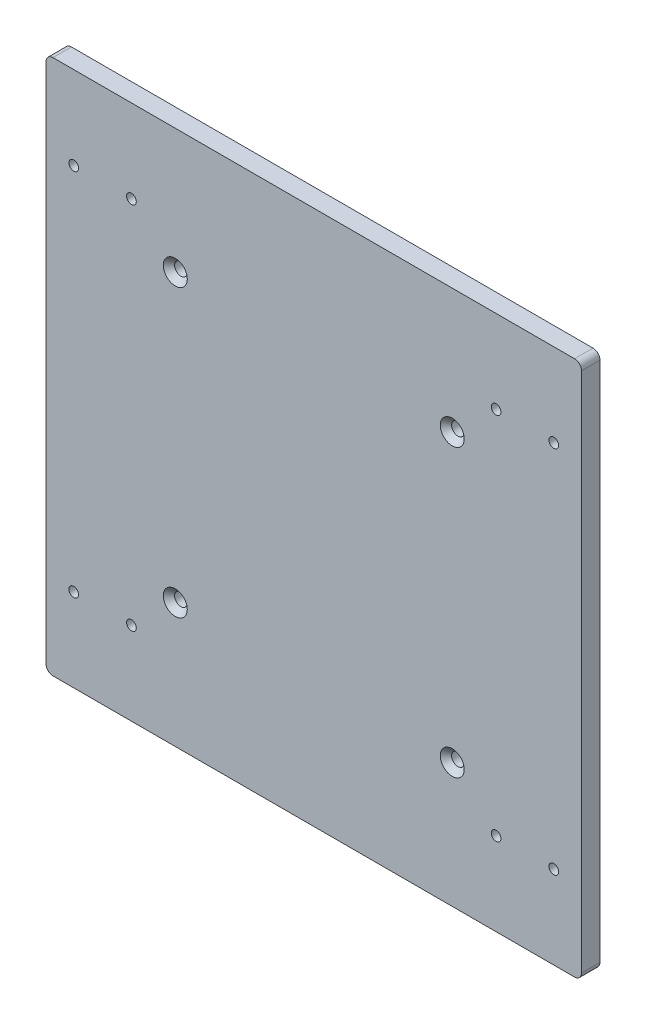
ISO-10303-21;
HEADER;
FILE_DESCRIPTION(('STEP AP214'),'2;1');
FILE_NAME('part.step','',(''),(''),'','','');
FILE_SCHEMA(('AUTOMOTIVE_DESIGN { 1 0 10303 214 1 1 1 1 }'));
ENDSEC;
DATA;
#1=APPLICATION_CONTEXT('core data for automotive mechanical design processes');
#2=APPLICATION_PROTOCOL_DEFINITION('international standard','automotive_design',2000,#1);
#3=PRODUCT_CONTEXT('',#1,'mechanical');
#4=PRODUCT('Part','Part','',(#3));
#5=PRODUCT_RELATED_PRODUCT_CATEGORY('part','',(#4));
#6=PRODUCT_DEFINITION_FORMATION('','',#4);
#7=PRODUCT_DEFINITION_CONTEXT('part definition',#1,'design');
#8=PRODUCT_DEFINITION('design','',#6,#7);
#9=PRODUCT_DEFINITION_SHAPE('','',#8);
#10=(LENGTH_UNIT() NAMED_UNIT(*) SI_UNIT(.MILLI.,.METRE.));
#11=(NAMED_UNIT(*) PLANE_ANGLE_UNIT() SI_UNIT($,.RADIAN.));
#12=(NAMED_UNIT(*) SI_UNIT($,.STERADIAN.) SOLID_ANGLE_UNIT());
#13=UNCERTAINTY_MEASURE_WITH_UNIT(LENGTH_MEASURE(1.E-05),#10,'distance_accuracy_value','');
#14=(GEOMETRIC_REPRESENTATION_CONTEXT(3) GLOBAL_UNCERTAINTY_ASSIGNED_CONTEXT((#13)) GLOBAL_UNIT_ASSIGNED_CONTEXT((#10,
#11,#12)) REPRESENTATION_CONTEXT('',''));
#15=CARTESIAN_POINT('',(0.,0.,0.));
#16=DIRECTION('',(0.,0.,1.));
#17=DIRECTION('',(1.,0.,0.));
#18=AXIS2_PLACEMENT_3D('',#15,#16,#17);
#19=CARTESIAN_POINT('',(-116.,116.,8.));
#20=DIRECTION('',(1.,0.,0.));
#21=DIRECTION('',(0.,0.,-1.));
#22=AXIS2_PLACEMENT_3D('',#19,#20,#21);
#23=PLANE('',#22);
#24=DIRECTION('',(0.,-1.,0.));
#25=VECTOR('',#24,1.);
#26=CARTESIAN_POINT('',(-116.,116.,8.));
#27=LINE('',#26,#25);
#28=CARTESIAN_POINT('',(-116.,113.,8.));
#29=VERTEX_POINT('',#28);
#30=CARTESIAN_POINT('',(-116.,-113.,8.));
#31=VERTEX_POINT('',#30);
#32=EDGE_CURVE('E121',#29,#31,#27,.T.);
#33=ORIENTED_EDGE('',*,*,#32,.F.);
#34=DIRECTION('',(0.,0.,-1.));
#35=VECTOR('',#34,1.);
#36=CARTESIAN_POINT('',(-116.,113.,8.));
#37=LINE('',#36,#35);
#38=CARTESIAN_POINT('',(-116.,113.,0.));
#39=VERTEX_POINT('',#38);
#40=EDGE_CURVE('E106',#29,#39,#37,.T.);
#41=ORIENTED_EDGE('',*,*,#40,.T.);
#42=DIRECTION('',(0.,-1.,0.));
#43=VECTOR('',#42,1.);
#44=CARTESIAN_POINT('',(-116.,116.,0.));
#45=LINE('',#44,#43);
#46=CARTESIAN_POINT('',(-116.,-113.,0.));
#47=VERTEX_POINT('',#46);
#48=EDGE_CURVE('E118',#39,#47,#45,.T.);
#49=ORIENTED_EDGE('',*,*,#48,.T.);
#50=DIRECTION('',(0.,0.,-1.));
#51=VECTOR('',#50,1.);
#52=CARTESIAN_POINT('',(-116.,-113.,8.));
#53=LINE('',#52,#51);
#54=EDGE_CURVE('E123',#47,#31,#53,.F.);
#55=ORIENTED_EDGE('',*,*,#54,.T.);
#56=EDGE_LOOP('',(#33,#41,#49,#55));
#57=FACE_BOUND('',#56,.T.);
#58=ADVANCED_FACE('F36',(#57),#23,.F.);
#59=CARTESIAN_POINT('',(-116.,-116.,8.));
#60=DIRECTION('',(0.,1.,0.));
#61=DIRECTION('',(0.,0.,1.));
#62=AXIS2_PLACEMENT_3D('',#59,#60,#61);
#63=PLANE('',#62);
#64=DIRECTION('',(1.,0.,0.));
#65=VECTOR('',#64,1.);
#66=CARTESIAN_POINT('',(-116.,-116.,0.));
#67=LINE('',#66,#65);
#68=CARTESIAN_POINT('',(-113.,-116.,0.));
#69=VERTEX_POINT('',#68);
#70=CARTESIAN_POINT('',(113.,-116.,0.));
#71=VERTEX_POINT('',#70);
#72=EDGE_CURVE('E127',#69,#71,#67,.T.);
#73=ORIENTED_EDGE('',*,*,#72,.T.);
#74=DIRECTION('',(0.,0.,-1.));
#75=VECTOR('',#74,1.);
#76=CARTESIAN_POINT('',(113.,-116.,8.));
#77=LINE('',#76,#75);
#78=CARTESIAN_POINT('',(113.,-116.,8.));
#79=VERTEX_POINT('',#78);
#80=EDGE_CURVE('E11',#71,#79,#77,.F.);
#81=ORIENTED_EDGE('',*,*,#80,.T.);
#82=DIRECTION('',(1.,0.,0.));
#83=VECTOR('',#82,1.);
#84=CARTESIAN_POINT('',(-116.,-116.,8.));
#85=LINE('',#84,#83);
#86=CARTESIAN_POINT('',(-113.,-116.,8.));
#87=VERTEX_POINT('',#86);
#88=EDGE_CURVE('E167',#87,#79,#85,.T.);
#89=ORIENTED_EDGE('',*,*,#88,.F.);
#90=DIRECTION('',(0.,0.,-1.));
#91=VECTOR('',#90,1.);
#92=CARTESIAN_POINT('',(-113.,-116.,8.));
#93=LINE('',#92,#91);
#94=EDGE_CURVE('E44',#87,#69,#93,.T.);
#95=ORIENTED_EDGE('',*,*,#94,.T.);
#96=EDGE_LOOP('',(#73,#81,#89,#95));
#97=FACE_BOUND('',#96,.T.);
#98=ADVANCED_FACE('F165',(#97),#63,.F.);
#99=CARTESIAN_POINT('',(116.,116.,8.));
#100=DIRECTION('',(-1.,0.,0.));
#101=DIRECTION('',(0.,0.,1.));
#102=AXIS2_PLACEMENT_3D('',#99,#100,#101);
#103=PLANE('',#102);
#104=DIRECTION('',(0.,1.,0.));
#105=VECTOR('',#104,1.);
#106=CARTESIAN_POINT('',(116.,116.,0.));
#107=LINE('',#106,#105);
#108=CARTESIAN_POINT('',(116.,-113.,0.));
#109=VERTEX_POINT('',#108);
#110=CARTESIAN_POINT('',(116.,113.,0.));
#111=VERTEX_POINT('',#110);
#112=EDGE_CURVE('E131',#109,#111,#107,.T.);
#113=ORIENTED_EDGE('',*,*,#112,.T.);
#114=DIRECTION('',(0.,0.,-1.));
#115=VECTOR('',#114,1.);
#116=CARTESIAN_POINT('',(116.,113.,8.));
#117=LINE('',#116,#115);
#118=CARTESIAN_POINT('',(116.,113.,8.));
#119=VERTEX_POINT('',#118);
#120=EDGE_CURVE('E51',#111,#119,#117,.F.);
#121=ORIENTED_EDGE('',*,*,#120,.T.);
#122=DIRECTION('',(0.,1.,0.));
#123=VECTOR('',#122,1.);
#124=CARTESIAN_POINT('',(116.,116.,8.));
#125=LINE('',#124,#123);
#126=CARTESIAN_POINT('',(116.,-113.,8.));
#127=VERTEX_POINT('',#126);
#128=EDGE_CURVE('E175',#127,#119,#125,.T.);
#129=ORIENTED_EDGE('',*,*,#128,.F.);
#130=DIRECTION('',(0.,0.,-1.));
#131=VECTOR('',#130,1.);
#132=CARTESIAN_POINT('',(116.,-113.,8.));
#133=LINE('',#132,#131);
#134=EDGE_CURVE('E158',#127,#109,#133,.T.);
#135=ORIENTED_EDGE('',*,*,#134,.T.);
#136=EDGE_LOOP('',(#113,#121,#129,#135));
#137=FACE_BOUND('',#136,.T.);
#138=ADVANCED_FACE('F174',(#137),#103,.F.);
#139=CARTESIAN_POINT('',(-116.,116.,8.));
#140=DIRECTION('',(0.,-1.,0.));
#141=DIRECTION('',(0.,0.,-1.));
#142=AXIS2_PLACEMENT_3D('',#139,#140,#141);
#143=PLANE('',#142);
#144=DIRECTION('',(-1.,0.,0.));
#145=VECTOR('',#144,1.);
#146=CARTESIAN_POINT('',(-116.,116.,0.));
#147=LINE('',#146,#145);
#148=CARTESIAN_POINT('',(113.,116.,0.));
#149=VERTEX_POINT('',#148);
#150=CARTESIAN_POINT('',(-113.,116.,0.));
#151=VERTEX_POINT('',#150);
#152=EDGE_CURVE('E141',#149,#151,#147,.T.);
#153=ORIENTED_EDGE('',*,*,#152,.T.);
#154=DIRECTION('',(0.,0.,-1.));
#155=VECTOR('',#154,1.);
#156=CARTESIAN_POINT('',(-113.,116.,8.));
#157=LINE('',#156,#155);
#158=CARTESIAN_POINT('',(-113.,116.,8.));
#159=VERTEX_POINT('',#158);
#160=EDGE_CURVE('E107',#151,#159,#157,.F.);
#161=ORIENTED_EDGE('',*,*,#160,.T.);
#162=DIRECTION('',(-1.,0.,0.));
#163=VECTOR('',#162,1.);
#164=CARTESIAN_POINT('',(-116.,116.,8.));
#165=LINE('',#164,#163);
#166=CARTESIAN_POINT('',(113.,116.,8.));
#167=VERTEX_POINT('',#166);
#168=EDGE_CURVE('E137',#167,#159,#165,.T.);
#169=ORIENTED_EDGE('',*,*,#168,.F.);
#170=DIRECTION('',(0.,0.,-1.));
#171=VECTOR('',#170,1.);
#172=CARTESIAN_POINT('',(113.,116.,8.));
#173=LINE('',#172,#171);
#174=EDGE_CURVE('E112',#167,#149,#173,.T.);
#175=ORIENTED_EDGE('',*,*,#174,.T.);
#176=EDGE_LOOP('',(#153,#161,#169,#175));
#177=FACE_BOUND('',#176,.T.);
#178=ADVANCED_FACE('F304',(#177),#143,.F.);
#179=CARTESIAN_POINT('',(0.,0.,8.));
#180=DIRECTION('',(0.,0.,1.));
#181=DIRECTION('',(1.,0.,0.));
#182=AXIS2_PLACEMENT_3D('',#179,#180,#181);
#183=PLANE('',#182);
#184=CARTESIAN_POINT('',(-79.,-80.,8.));
#185=DIRECTION('',(0.,0.,-1.));
#186=DIRECTION('',(-1.,0.,0.));
#187=AXIS2_PLACEMENT_3D('',#184,#185,#186);
#188=CIRCLE('',#187,2.1);
#189=CARTESIAN_POINT('',(-81.1,-80.,8.));
#190=VERTEX_POINT('',#189);
#191=EDGE_CURVE('E255',#190,#190,#188,.T.);
#192=ORIENTED_EDGE('',*,*,#191,.T.);
#193=EDGE_LOOP('',(#192));
#194=FACE_BOUND('',#193,.T.);
#195=CARTESIAN_POINT('',(-104.,-80.,8.));
#196=DIRECTION('',(0.,0.,-1.));
#197=DIRECTION('',(-1.,0.,0.));
#198=AXIS2_PLACEMENT_3D('',#195,#196,#197);
#199=CIRCLE('',#198,2.1);
#200=CARTESIAN_POINT('',(-106.1,-80.,8.));
#201=VERTEX_POINT('',#200);
#202=EDGE_CURVE('E249',#201,#201,#199,.T.);
#203=ORIENTED_EDGE('',*,*,#202,.T.);
#204=EDGE_LOOP('',(#203));
#205=FACE_BOUND('',#204,.T.);
#206=CARTESIAN_POINT('',(79.,-80.,8.));
#207=DIRECTION('',(0.,0.,-1.));
#208=DIRECTION('',(-1.,0.,0.));
#209=AXIS2_PLACEMENT_3D('',#206,#207,#208);
#210=CIRCLE('',#209,2.09999999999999);
#211=CARTESIAN_POINT('',(76.9,-80.,8.));
#212=VERTEX_POINT('',#211);
#213=EDGE_CURVE('E243',#212,#212,#210,.T.);
#214=ORIENTED_EDGE('',*,*,#213,.T.);
#215=EDGE_LOOP('',(#214));
#216=FACE_BOUND('',#215,.T.);
#217=CARTESIAN_POINT('',(104.,-80.,8.));
#218=DIRECTION('',(0.,0.,-1.));
#219=DIRECTION('',(-1.,0.,0.));
#220=AXIS2_PLACEMENT_3D('',#217,#218,#219);
#221=CIRCLE('',#220,2.09999999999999);
#222=CARTESIAN_POINT('',(101.9,-80.,8.));
#223=VERTEX_POINT('',#222);
#224=EDGE_CURVE('E237',#223,#223,#221,.T.);
#225=ORIENTED_EDGE('',*,*,#224,.T.);
#226=EDGE_LOOP('',(#225));
#227=FACE_BOUND('',#226,.T.);
#228=CARTESIAN_POINT('',(79.,80.,8.));
#229=DIRECTION('',(0.,0.,-1.));
#230=DIRECTION('',(-1.,0.,0.));
#231=AXIS2_PLACEMENT_3D('',#228,#229,#230);
#232=CIRCLE('',#231,2.09999999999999);
#233=CARTESIAN_POINT('',(76.9,80.,8.));
#234=VERTEX_POINT('',#233);
#235=EDGE_CURVE('E231',#234,#234,#232,.T.);
#236=ORIENTED_EDGE('',*,*,#235,.T.);
#237=EDGE_LOOP('',(#236));
#238=FACE_BOUND('',#237,.T.);
#239=CARTESIAN_POINT('',(104.,80.,8.));
#240=DIRECTION('',(0.,0.,-1.));
#241=DIRECTION('',(-1.,0.,0.));
#242=AXIS2_PLACEMENT_3D('',#239,#240,#241);
#243=CIRCLE('',#242,2.09999999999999);
#244=CARTESIAN_POINT('',(101.9,80.,8.));
#245=VERTEX_POINT('',#244);
#246=EDGE_CURVE('E225',#245,#245,#243,.T.);
#247=ORIENTED_EDGE('',*,*,#246,.T.);
#248=EDGE_LOOP('',(#247));
#249=FACE_BOUND('',#248,.T.);
#250=CARTESIAN_POINT('',(-104.,80.,8.));
#251=DIRECTION('',(0.,0.,-1.));
#252=DIRECTION('',(-1.,0.,0.));
#253=AXIS2_PLACEMENT_3D('',#250,#251,#252);
#254=CIRCLE('',#253,2.09999999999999);
#255=CARTESIAN_POINT('',(-106.1,80.,8.));
#256=VERTEX_POINT('',#255);
#257=EDGE_CURVE('E219',#256,#256,#254,.T.);
#258=ORIENTED_EDGE('',*,*,#257,.T.);
#259=EDGE_LOOP('',(#258));
#260=FACE_BOUND('',#259,.T.);
#261=CARTESIAN_POINT('',(-79.,80.,8.));
#262=DIRECTION('',(0.,0.,-1.));
#263=DIRECTION('',(-1.,0.,0.));
#264=AXIS2_PLACEMENT_3D('',#261,#262,#263);
#265=CIRCLE('',#264,2.09999999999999);
#266=CARTESIAN_POINT('',(-81.1,80.,8.));
#267=VERTEX_POINT('',#266);
#268=EDGE_CURVE('E213',#267,#267,#265,.T.);
#269=ORIENTED_EDGE('',*,*,#268,.T.);
#270=EDGE_LOOP('',(#269));
#271=FACE_BOUND('',#270,.T.);
#272=CARTESIAN_POINT('',(60.,62.,8.));
#273=DIRECTION('',(0.,0.,1.));
#274=DIRECTION('',(1.,0.,0.));
#275=AXIS2_PLACEMENT_3D('',#272,#273,#274);
#276=CIRCLE('',#275,5.2);
#277=CARTESIAN_POINT('',(65.2,62.,8.));
#278=VERTEX_POINT('',#277);
#279=EDGE_CURVE('E210',#278,#278,#276,.T.);
#280=ORIENTED_EDGE('',*,*,#279,.F.);
#281=EDGE_LOOP('',(#280));
#282=FACE_BOUND('',#281,.T.);
#283=CARTESIAN_POINT('',(-60.,-62.,8.));
#284=DIRECTION('',(0.,0.,1.));
#285=DIRECTION('',(1.,0.,0.));
#286=AXIS2_PLACEMENT_3D('',#283,#284,#285);
#287=CIRCLE('',#286,5.2);
#288=CARTESIAN_POINT('',(-54.8,-62.,8.));
#289=VERTEX_POINT('',#288);
#290=EDGE_CURVE('E201',#289,#289,#287,.T.);
#291=ORIENTED_EDGE('',*,*,#290,.F.);
#292=EDGE_LOOP('',(#291));
#293=FACE_BOUND('',#292,.T.);
#294=CARTESIAN_POINT('',(-60.,62.,8.));
#295=DIRECTION('',(0.,0.,1.));
#296=DIRECTION('',(1.,0.,0.));
#297=AXIS2_PLACEMENT_3D('',#294,#295,#296);
#298=CIRCLE('',#297,5.2);
#299=CARTESIAN_POINT('',(-54.8,62.,8.));
#300=VERTEX_POINT('',#299);
#301=EDGE_CURVE('E192',#300,#300,#298,.T.);
#302=ORIENTED_EDGE('',*,*,#301,.F.);
#303=EDGE_LOOP('',(#302));
#304=FACE_BOUND('',#303,.T.);
#305=CARTESIAN_POINT('',(60.,-62.,8.));
#306=DIRECTION('',(0.,0.,1.));
#307=DIRECTION('',(1.,0.,0.));
#308=AXIS2_PLACEMENT_3D('',#305,#306,#307);
#309=CIRCLE('',#308,5.2);
#310=CARTESIAN_POINT('',(65.2,-62.,8.));
#311=VERTEX_POINT('',#310);
#312=EDGE_CURVE('E183',#311,#311,#309,.T.);
#313=ORIENTED_EDGE('',*,*,#312,.F.);
#314=EDGE_LOOP('',(#313));
#315=FACE_BOUND('',#314,.T.);
#316=ORIENTED_EDGE('',*,*,#168,.T.);
#317=CARTESIAN_POINT('',(-113.,113.,8.));
#318=DIRECTION('',(0.,0.,1.));
#319=DIRECTION('',(1.,0.,0.));
#320=AXIS2_PLACEMENT_3D('',#317,#318,#319);
#321=CIRCLE('',#320,3.);
#322=EDGE_CURVE('E156',#159,#29,#321,.T.);
#323=ORIENTED_EDGE('',*,*,#322,.T.);
#324=ORIENTED_EDGE('',*,*,#32,.T.);
#325=CARTESIAN_POINT('',(-113.,-113.,8.));
#326=DIRECTION('',(0.,0.,1.));
#327=DIRECTION('',(1.,0.,0.));
#328=AXIS2_PLACEMENT_3D('',#325,#326,#327);
#329=CIRCLE('',#328,3.);
#330=EDGE_CURVE('E151',#31,#87,#329,.T.);
#331=ORIENTED_EDGE('',*,*,#330,.T.);
#332=ORIENTED_EDGE('',*,*,#88,.T.);
#333=CARTESIAN_POINT('',(113.,-113.,8.));
#334=DIRECTION('',(0.,0.,1.));
#335=DIRECTION('',(1.,0.,0.));
#336=AXIS2_PLACEMENT_3D('',#333,#334,#335);
#337=CIRCLE('',#336,3.);
#338=EDGE_CURVE('E58',#79,#127,#337,.T.);
#339=ORIENTED_EDGE('',*,*,#338,.T.);
#340=ORIENTED_EDGE('',*,*,#128,.T.);
#341=CARTESIAN_POINT('',(113.,113.,8.));
#342=DIRECTION('',(0.,0.,1.));
#343=DIRECTION('',(1.,0.,0.));
#344=AXIS2_PLACEMENT_3D('',#341,#342,#343);
#345=CIRCLE('',#344,3.);
#346=EDGE_CURVE('E154',#119,#167,#345,.T.);
#347=ORIENTED_EDGE('',*,*,#346,.T.);
#348=EDGE_LOOP('',(#316,#323,#324,#331,#332,#339,#340,#347));
#349=FACE_BOUND('',#348,.T.);
#350=ADVANCED_FACE('F267',(#194,#205,#216,#227,#238,#249,#260,#271,#282,#293,#304,#315,#349),
#183,.T.);
#351=CARTESIAN_POINT('',(0.,0.,0.));
#352=DIRECTION('',(0.,0.,1.));
#353=DIRECTION('',(1.,0.,0.));
#354=AXIS2_PLACEMENT_3D('',#351,#352,#353);
#355=PLANE('',#354);
#356=CARTESIAN_POINT('',(-79.,-80.,0.));
#357=DIRECTION('',(0.,0.,-1.));
#358=DIRECTION('',(-1.,0.,0.));
#359=AXIS2_PLACEMENT_3D('',#356,#357,#358);
#360=CIRCLE('',#359,2.09999999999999);
#361=CARTESIAN_POINT('',(-81.1,-80.,0.));
#362=VERTEX_POINT('',#361);
#363=EDGE_CURVE('E258',#362,#362,#360,.T.);
#364=ORIENTED_EDGE('',*,*,#363,.F.);
#365=EDGE_LOOP('',(#364));
#366=FACE_BOUND('',#365,.T.);
#367=CARTESIAN_POINT('',(-104.,-80.,0.));
#368=DIRECTION('',(0.,0.,-1.));
#369=DIRECTION('',(-1.,0.,0.));
#370=AXIS2_PLACEMENT_3D('',#367,#368,#369);
#371=CIRCLE('',#370,2.09999999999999);
#372=CARTESIAN_POINT('',(-106.1,-80.,0.));
#373=VERTEX_POINT('',#372);
#374=EDGE_CURVE('E252',#373,#373,#371,.T.);
#375=ORIENTED_EDGE('',*,*,#374,.F.);
#376=EDGE_LOOP('',(#375));
#377=FACE_BOUND('',#376,.T.);
#378=CARTESIAN_POINT('',(79.,-80.,0.));
#379=DIRECTION('',(0.,0.,-1.));
#380=DIRECTION('',(-1.,0.,0.));
#381=AXIS2_PLACEMENT_3D('',#378,#379,#380);
#382=CIRCLE('',#381,2.09999999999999);
#383=CARTESIAN_POINT('',(76.9,-80.,0.));
#384=VERTEX_POINT('',#383);
#385=EDGE_CURVE('E246',#384,#384,#382,.T.);
#386=ORIENTED_EDGE('',*,*,#385,.F.);
#387=EDGE_LOOP('',(#386));
#388=FACE_BOUND('',#387,.T.);
#389=CARTESIAN_POINT('',(104.,-80.,0.));
#390=DIRECTION('',(0.,0.,-1.));
#391=DIRECTION('',(-1.,0.,0.));
#392=AXIS2_PLACEMENT_3D('',#389,#390,#391);
#393=CIRCLE('',#392,2.09999999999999);
#394=CARTESIAN_POINT('',(101.9,-80.,0.));
#395=VERTEX_POINT('',#394);
#396=EDGE_CURVE('E240',#395,#395,#393,.T.);
#397=ORIENTED_EDGE('',*,*,#396,.F.);
#398=EDGE_LOOP('',(#397));
#399=FACE_BOUND('',#398,.T.);
#400=CARTESIAN_POINT('',(79.,80.,0.));
#401=DIRECTION('',(0.,0.,-1.));
#402=DIRECTION('',(-1.,0.,0.));
#403=AXIS2_PLACEMENT_3D('',#400,#401,#402);
#404=CIRCLE('',#403,2.09999999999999);
#405=CARTESIAN_POINT('',(76.9,80.,0.));
#406=VERTEX_POINT('',#405);
#407=EDGE_CURVE('E234',#406,#406,#404,.T.);
#408=ORIENTED_EDGE('',*,*,#407,.F.);
#409=EDGE_LOOP('',(#408));
#410=FACE_BOUND('',#409,.T.);
#411=CARTESIAN_POINT('',(104.,80.,0.));
#412=DIRECTION('',(0.,0.,-1.));
#413=DIRECTION('',(-1.,0.,0.));
#414=AXIS2_PLACEMENT_3D('',#411,#412,#413);
#415=CIRCLE('',#414,2.09999999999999);
#416=CARTESIAN_POINT('',(101.9,80.,0.));
#417=VERTEX_POINT('',#416);
#418=EDGE_CURVE('E228',#417,#417,#415,.T.);
#419=ORIENTED_EDGE('',*,*,#418,.F.);
#420=EDGE_LOOP('',(#419));
#421=FACE_BOUND('',#420,.T.);
#422=CARTESIAN_POINT('',(-104.,80.,0.));
#423=DIRECTION('',(0.,0.,-1.));
#424=DIRECTION('',(-1.,0.,0.));
#425=AXIS2_PLACEMENT_3D('',#422,#423,#424);
#426=CIRCLE('',#425,2.09999999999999);
#427=CARTESIAN_POINT('',(-106.1,80.,0.));
#428=VERTEX_POINT('',#427);
#429=EDGE_CURVE('E222',#428,#428,#426,.T.);
#430=ORIENTED_EDGE('',*,*,#429,.F.);
#431=EDGE_LOOP('',(#430));
#432=FACE_BOUND('',#431,.T.);
#433=CARTESIAN_POINT('',(-79.,80.,0.));
#434=DIRECTION('',(0.,0.,-1.));
#435=DIRECTION('',(-1.,0.,0.));
#436=AXIS2_PLACEMENT_3D('',#433,#434,#435);
#437=CIRCLE('',#436,2.09999999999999);
#438=CARTESIAN_POINT('',(-81.1,80.,0.));
#439=VERTEX_POINT('',#438);
#440=EDGE_CURVE('E216',#439,#439,#437,.T.);
#441=ORIENTED_EDGE('',*,*,#440,.F.);
#442=EDGE_LOOP('',(#441));
#443=FACE_BOUND('',#442,.T.);
#444=CARTESIAN_POINT('',(60.,62.,0.));
#445=DIRECTION('',(0.,0.,1.));
#446=DIRECTION('',(1.,0.,0.));
#447=AXIS2_PLACEMENT_3D('',#444,#445,#446);
#448=CIRCLE('',#447,2.75);
#449=CARTESIAN_POINT('',(62.75,62.,0.));
#450=VERTEX_POINT('',#449);
#451=EDGE_CURVE('E204',#450,#450,#448,.T.);
#452=ORIENTED_EDGE('',*,*,#451,.T.);
#453=EDGE_LOOP('',(#452));
#454=FACE_BOUND('',#453,.T.);
#455=CARTESIAN_POINT('',(-60.,-62.,0.));
#456=DIRECTION('',(0.,0.,1.));
#457=DIRECTION('',(1.,0.,0.));
#458=AXIS2_PLACEMENT_3D('',#455,#456,#457);
#459=CIRCLE('',#458,2.75);
#460=CARTESIAN_POINT('',(-57.25,-62.,0.));
#461=VERTEX_POINT('',#460);
#462=EDGE_CURVE('E195',#461,#461,#459,.T.);
#463=ORIENTED_EDGE('',*,*,#462,.T.);
#464=EDGE_LOOP('',(#463));
#465=FACE_BOUND('',#464,.T.);
#466=CARTESIAN_POINT('',(-60.,62.,0.));
#467=DIRECTION('',(0.,0.,1.));
#468=DIRECTION('',(1.,0.,0.));
#469=AXIS2_PLACEMENT_3D('',#466,#467,#468);
#470=CIRCLE('',#469,2.75);
#471=CARTESIAN_POINT('',(-57.25,62.,0.));
#472=VERTEX_POINT('',#471);
#473=EDGE_CURVE('E186',#472,#472,#470,.T.);
#474=ORIENTED_EDGE('',*,*,#473,.T.);
#475=EDGE_LOOP('',(#474));
#476=FACE_BOUND('',#475,.T.);
#477=CARTESIAN_POINT('',(60.,-62.,0.));
#478=DIRECTION('',(0.,0.,1.));
#479=DIRECTION('',(1.,0.,0.));
#480=AXIS2_PLACEMENT_3D('',#477,#478,#479);
#481=CIRCLE('',#480,2.75);
#482=CARTESIAN_POINT('',(62.75,-62.,0.));
#483=VERTEX_POINT('',#482);
#484=EDGE_CURVE('E128',#483,#483,#481,.T.);
#485=ORIENTED_EDGE('',*,*,#484,.T.);
#486=EDGE_LOOP('',(#485));
#487=FACE_BOUND('',#486,.T.);
#488=ORIENTED_EDGE('',*,*,#48,.F.);
#489=CARTESIAN_POINT('',(-113.,113.,0.));
#490=DIRECTION('',(0.,0.,1.));
#491=DIRECTION('',(1.,0.,0.));
#492=AXIS2_PLACEMENT_3D('',#489,#490,#491);
#493=CIRCLE('',#492,3.);
#494=EDGE_CURVE('E102',#39,#151,#493,.F.);
#495=ORIENTED_EDGE('',*,*,#494,.T.);
#496=ORIENTED_EDGE('',*,*,#152,.F.);
#497=CARTESIAN_POINT('',(113.,113.,0.));
#498=DIRECTION('',(0.,0.,1.));
#499=DIRECTION('',(1.,0.,0.));
#500=AXIS2_PLACEMENT_3D('',#497,#498,#499);
#501=CIRCLE('',#500,3.);
#502=EDGE_CURVE('E113',#149,#111,#501,.F.);
#503=ORIENTED_EDGE('',*,*,#502,.T.);
#504=ORIENTED_EDGE('',*,*,#112,.F.);
#505=CARTESIAN_POINT('',(113.,-113.,0.));
#506=DIRECTION('',(0.,0.,1.));
#507=DIRECTION('',(1.,0.,0.));
#508=AXIS2_PLACEMENT_3D('',#505,#506,#507);
#509=CIRCLE('',#508,3.);
#510=EDGE_CURVE('E145',#109,#71,#509,.F.);
#511=ORIENTED_EDGE('',*,*,#510,.T.);
#512=ORIENTED_EDGE('',*,*,#72,.F.);
#513=CARTESIAN_POINT('',(-113.,-113.,0.));
#514=DIRECTION('',(0.,0.,1.));
#515=DIRECTION('',(1.,0.,0.));
#516=AXIS2_PLACEMENT_3D('',#513,#514,#515);
#517=CIRCLE('',#516,3.);
#518=EDGE_CURVE('E122',#69,#47,#517,.F.);
#519=ORIENTED_EDGE('',*,*,#518,.T.);
#520=EDGE_LOOP('',(#488,#495,#496,#503,#504,#511,#512,#519));
#521=FACE_BOUND('',#520,.T.);
#522=ADVANCED_FACE('F125',(#366,#377,#388,#399,#410,#421,#432,#443,#454,#465,#476,#487,#521),
#355,.F.);
#523=CARTESIAN_POINT('',(60.,-62.,8.));
#524=DIRECTION('',(0.,0.,1.));
#525=DIRECTION('',(1.,0.,0.));
#526=AXIS2_PLACEMENT_3D('',#523,#524,#525);
#527=CYLINDRICAL_SURFACE('',#526,2.75);
#528=ORIENTED_EDGE('',*,*,#484,.F.);
#529=EDGE_LOOP('',(#528));
#530=FACE_BOUND('',#529,.T.);
#531=CARTESIAN_POINT('',(60.,-62.,5.55));
#532=DIRECTION('',(0.,0.,1.));
#533=DIRECTION('',(1.,0.,0.));
#534=AXIS2_PLACEMENT_3D('',#531,#532,#533);
#535=CIRCLE('',#534,2.75);
#536=CARTESIAN_POINT('',(62.75,-62.,5.55));
#537=VERTEX_POINT('',#536);
#538=EDGE_CURVE('E134',#537,#537,#535,.T.);
#539=ORIENTED_EDGE('',*,*,#538,.T.);
#540=EDGE_LOOP('',(#539));
#541=FACE_BOUND('',#540,.T.);
#542=ADVANCED_FACE('F266',(#530,#541),#527,.F.);
#543=CARTESIAN_POINT('',(60.,-62.,8.));
#544=DIRECTION('',(0.,0.,1.));
#545=DIRECTION('',(1.,0.,0.));
#546=AXIS2_PLACEMENT_3D('',#543,#544,#545);
#547=CONICAL_SURFACE('',#546,5.2,0.785398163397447);
#548=ORIENTED_EDGE('',*,*,#538,.F.);
#549=EDGE_LOOP('',(#548));
#550=FACE_BOUND('',#549,.T.);
#551=ORIENTED_EDGE('',*,*,#312,.T.);
#552=EDGE_LOOP('',(#551));
#553=FACE_BOUND('',#552,.T.);
#554=ADVANCED_FACE('F293',(#550,#553),#547,.F.);
#555=CARTESIAN_POINT('',(-60.,62.,8.));
#556=DIRECTION('',(0.,0.,1.));
#557=DIRECTION('',(1.,0.,0.));
#558=AXIS2_PLACEMENT_3D('',#555,#556,#557);
#559=CYLINDRICAL_SURFACE('',#558,2.75);
#560=ORIENTED_EDGE('',*,*,#473,.F.);
#561=EDGE_LOOP('',(#560));
#562=FACE_BOUND('',#561,.T.);
#563=CARTESIAN_POINT('',(-60.,62.,5.55));
#564=DIRECTION('',(0.,0.,1.));
#565=DIRECTION('',(1.,0.,0.));
#566=AXIS2_PLACEMENT_3D('',#563,#564,#565);
#567=CIRCLE('',#566,2.75);
#568=CARTESIAN_POINT('',(-57.25,62.,5.55));
#569=VERTEX_POINT('',#568);
#570=EDGE_CURVE('E189',#569,#569,#567,.T.);
#571=ORIENTED_EDGE('',*,*,#570,.T.);
#572=EDGE_LOOP('',(#571));
#573=FACE_BOUND('',#572,.T.);
#574=ADVANCED_FACE('F299',(#562,#573),#559,.F.);
#575=CARTESIAN_POINT('',(-60.,62.,8.));
#576=DIRECTION('',(0.,0.,1.));
#577=DIRECTION('',(1.,0.,0.));
#578=AXIS2_PLACEMENT_3D('',#575,#576,#577);
#579=CONICAL_SURFACE('',#578,5.2,0.785398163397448);
#580=ORIENTED_EDGE('',*,*,#570,.F.);
#581=EDGE_LOOP('',(#580));
#582=FACE_BOUND('',#581,.T.);
#583=ORIENTED_EDGE('',*,*,#301,.T.);
#584=EDGE_LOOP('',(#583));
#585=FACE_BOUND('',#584,.T.);
#586=ADVANCED_FACE('F333',(#582,#585),#579,.F.);
#587=CARTESIAN_POINT('',(-60.,-62.,8.));
#588=DIRECTION('',(0.,0.,1.));
#589=DIRECTION('',(1.,0.,0.));
#590=AXIS2_PLACEMENT_3D('',#587,#588,#589);
#591=CYLINDRICAL_SURFACE('',#590,2.75);
#592=ORIENTED_EDGE('',*,*,#462,.F.);
#593=EDGE_LOOP('',(#592));
#594=FACE_BOUND('',#593,.T.);
#595=CARTESIAN_POINT('',(-60.,-62.,5.55));
#596=DIRECTION('',(0.,0.,1.));
#597=DIRECTION('',(1.,0.,0.));
#598=AXIS2_PLACEMENT_3D('',#595,#596,#597);
#599=CIRCLE('',#598,2.75);
#600=CARTESIAN_POINT('',(-57.25,-62.,5.55));
#601=VERTEX_POINT('',#600);
#602=EDGE_CURVE('E198',#601,#601,#599,.T.);
#603=ORIENTED_EDGE('',*,*,#602,.T.);
#604=EDGE_LOOP('',(#603));
#605=FACE_BOUND('',#604,.T.);
#606=ADVANCED_FACE('F337',(#594,#605),#591,.F.);
#607=CARTESIAN_POINT('',(-60.,-62.,8.));
#608=DIRECTION('',(0.,0.,1.));
#609=DIRECTION('',(1.,0.,0.));
#610=AXIS2_PLACEMENT_3D('',#607,#608,#609);
#611=CONICAL_SURFACE('',#610,5.2,0.785398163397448);
#612=ORIENTED_EDGE('',*,*,#602,.F.);
#613=EDGE_LOOP('',(#612));
#614=FACE_BOUND('',#613,.T.);
#615=ORIENTED_EDGE('',*,*,#290,.T.);
#616=EDGE_LOOP('',(#615));
#617=FACE_BOUND('',#616,.T.);
#618=ADVANCED_FACE('F341',(#614,#617),#611,.F.);
#619=CARTESIAN_POINT('',(60.,62.,8.));
#620=DIRECTION('',(0.,0.,1.));
#621=DIRECTION('',(1.,0.,0.));
#622=AXIS2_PLACEMENT_3D('',#619,#620,#621);
#623=CYLINDRICAL_SURFACE('',#622,2.75);
#624=ORIENTED_EDGE('',*,*,#451,.F.);
#625=EDGE_LOOP('',(#624));
#626=FACE_BOUND('',#625,.T.);
#627=CARTESIAN_POINT('',(60.,62.,5.55));
#628=DIRECTION('',(0.,0.,1.));
#629=DIRECTION('',(1.,0.,0.));
#630=AXIS2_PLACEMENT_3D('',#627,#628,#629);
#631=CIRCLE('',#630,2.75);
#632=CARTESIAN_POINT('',(62.75,62.,5.55));
#633=VERTEX_POINT('',#632);
#634=EDGE_CURVE('E207',#633,#633,#631,.T.);
#635=ORIENTED_EDGE('',*,*,#634,.T.);
#636=EDGE_LOOP('',(#635));
#637=FACE_BOUND('',#636,.T.);
#638=ADVANCED_FACE('F345',(#626,#637),#623,.F.);
#639=CARTESIAN_POINT('',(60.,62.,8.));
#640=DIRECTION('',(0.,0.,1.));
#641=DIRECTION('',(1.,0.,0.));
#642=AXIS2_PLACEMENT_3D('',#639,#640,#641);
#643=CONICAL_SURFACE('',#642,5.2,0.785398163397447);
#644=ORIENTED_EDGE('',*,*,#634,.F.);
#645=EDGE_LOOP('',(#644));
#646=FACE_BOUND('',#645,.T.);
#647=ORIENTED_EDGE('',*,*,#279,.T.);
#648=EDGE_LOOP('',(#647));
#649=FACE_BOUND('',#648,.T.);
#650=ADVANCED_FACE('F318',(#646,#649),#643,.F.);
#651=CARTESIAN_POINT('',(-113.,113.,8.));
#652=DIRECTION('',(0.,0.,-1.));
#653=DIRECTION('',(-1.,0.,0.));
#654=AXIS2_PLACEMENT_3D('',#651,#652,#653);
#655=CYLINDRICAL_SURFACE('',#654,3.);
#656=ORIENTED_EDGE('',*,*,#322,.F.);
#657=ORIENTED_EDGE('',*,*,#160,.F.);
#658=ORIENTED_EDGE('',*,*,#494,.F.);
#659=ORIENTED_EDGE('',*,*,#40,.F.);
#660=EDGE_LOOP('',(#656,#657,#658,#659));
#661=FACE_BOUND('',#660,.T.);
#662=ADVANCED_FACE('F105',(#661),#655,.T.);
#663=CARTESIAN_POINT('',(113.,113.,8.));
#664=DIRECTION('',(0.,0.,-1.));
#665=DIRECTION('',(-1.,0.,0.));
#666=AXIS2_PLACEMENT_3D('',#663,#664,#665);
#667=CYLINDRICAL_SURFACE('',#666,3.);
#668=ORIENTED_EDGE('',*,*,#346,.F.);
#669=ORIENTED_EDGE('',*,*,#120,.F.);
#670=ORIENTED_EDGE('',*,*,#502,.F.);
#671=ORIENTED_EDGE('',*,*,#174,.F.);
#672=EDGE_LOOP('',(#668,#669,#670,#671));
#673=FACE_BOUND('',#672,.T.);
#674=ADVANCED_FACE('F311',(#673),#667,.T.);
#675=CARTESIAN_POINT('',(113.,-113.,8.));
#676=DIRECTION('',(0.,0.,-1.));
#677=DIRECTION('',(-1.,0.,0.));
#678=AXIS2_PLACEMENT_3D('',#675,#676,#677);
#679=CYLINDRICAL_SURFACE('',#678,3.);
#680=ORIENTED_EDGE('',*,*,#338,.F.);
#681=ORIENTED_EDGE('',*,*,#80,.F.);
#682=ORIENTED_EDGE('',*,*,#510,.F.);
#683=ORIENTED_EDGE('',*,*,#134,.F.);
#684=EDGE_LOOP('',(#680,#681,#682,#683));
#685=FACE_BOUND('',#684,.T.);
#686=ADVANCED_FACE('F173',(#685),#679,.T.);
#687=CARTESIAN_POINT('',(-113.,-113.,8.));
#688=DIRECTION('',(0.,0.,-1.));
#689=DIRECTION('',(-1.,0.,0.));
#690=AXIS2_PLACEMENT_3D('',#687,#688,#689);
#691=CYLINDRICAL_SURFACE('',#690,3.);
#692=ORIENTED_EDGE('',*,*,#330,.F.);
#693=ORIENTED_EDGE('',*,*,#54,.F.);
#694=ORIENTED_EDGE('',*,*,#518,.F.);
#695=ORIENTED_EDGE('',*,*,#94,.F.);
#696=EDGE_LOOP('',(#692,#693,#694,#695));
#697=FACE_BOUND('',#696,.T.);
#698=ADVANCED_FACE('F38',(#697),#691,.T.);
#699=CARTESIAN_POINT('',(-79.,80.,0.));
#700=DIRECTION('',(0.,0.,-1.));
#701=DIRECTION('',(-1.,0.,0.));
#702=AXIS2_PLACEMENT_3D('',#699,#700,#701);
#703=CYLINDRICAL_SURFACE('',#702,2.09999999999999);
#704=ORIENTED_EDGE('',*,*,#268,.F.);
#705=EDGE_LOOP('',(#704));
#706=FACE_BOUND('',#705,.T.);
#707=ORIENTED_EDGE('',*,*,#440,.T.);
#708=EDGE_LOOP('',(#707));
#709=FACE_BOUND('',#708,.T.);
#710=ADVANCED_FACE('F353',(#706,#709),#703,.F.);
#711=CARTESIAN_POINT('',(-104.,80.,0.));
#712=DIRECTION('',(0.,0.,-1.));
#713=DIRECTION('',(-1.,0.,0.));
#714=AXIS2_PLACEMENT_3D('',#711,#712,#713);
#715=CYLINDRICAL_SURFACE('',#714,2.09999999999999);
#716=ORIENTED_EDGE('',*,*,#257,.F.);
#717=EDGE_LOOP('',(#716));
#718=FACE_BOUND('',#717,.T.);
#719=ORIENTED_EDGE('',*,*,#429,.T.);
#720=EDGE_LOOP('',(#719));
#721=FACE_BOUND('',#720,.T.);
#722=ADVANCED_FACE('F356',(#718,#721),#715,.F.);
#723=CARTESIAN_POINT('',(104.,80.,0.));
#724=DIRECTION('',(0.,0.,-1.));
#725=DIRECTION('',(-1.,0.,0.));
#726=AXIS2_PLACEMENT_3D('',#723,#724,#725);
#727=CYLINDRICAL_SURFACE('',#726,2.09999999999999);
#728=ORIENTED_EDGE('',*,*,#246,.F.);
#729=EDGE_LOOP('',(#728));
#730=FACE_BOUND('',#729,.T.);
#731=ORIENTED_EDGE('',*,*,#418,.T.);
#732=EDGE_LOOP('',(#731));
#733=FACE_BOUND('',#732,.T.);
#734=ADVANCED_FACE('F360',(#730,#733),#727,.F.);
#735=CARTESIAN_POINT('',(79.,80.,0.));
#736=DIRECTION('',(0.,0.,-1.));
#737=DIRECTION('',(-1.,0.,0.));
#738=AXIS2_PLACEMENT_3D('',#735,#736,#737);
#739=CYLINDRICAL_SURFACE('',#738,2.09999999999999);
#740=ORIENTED_EDGE('',*,*,#235,.F.);
#741=EDGE_LOOP('',(#740));
#742=FACE_BOUND('',#741,.T.);
#743=ORIENTED_EDGE('',*,*,#407,.T.);
#744=EDGE_LOOP('',(#743));
#745=FACE_BOUND('',#744,.T.);
#746=ADVANCED_FACE('F364',(#742,#745),#739,.F.);
#747=CARTESIAN_POINT('',(104.,-80.,0.));
#748=DIRECTION('',(0.,0.,-1.));
#749=DIRECTION('',(-1.,0.,0.));
#750=AXIS2_PLACEMENT_3D('',#747,#748,#749);
#751=CYLINDRICAL_SURFACE('',#750,2.09999999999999);
#752=ORIENTED_EDGE('',*,*,#224,.F.);
#753=EDGE_LOOP('',(#752));
#754=FACE_BOUND('',#753,.T.);
#755=ORIENTED_EDGE('',*,*,#396,.T.);
#756=EDGE_LOOP('',(#755));
#757=FACE_BOUND('',#756,.T.);
#758=ADVANCED_FACE('F368',(#754,#757),#751,.F.);
#759=CARTESIAN_POINT('',(79.,-80.,0.));
#760=DIRECTION('',(0.,0.,-1.));
#761=DIRECTION('',(-1.,0.,0.));
#762=AXIS2_PLACEMENT_3D('',#759,#760,#761);
#763=CYLINDRICAL_SURFACE('',#762,2.09999999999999);
#764=ORIENTED_EDGE('',*,*,#213,.F.);
#765=EDGE_LOOP('',(#764));
#766=FACE_BOUND('',#765,.T.);
#767=ORIENTED_EDGE('',*,*,#385,.T.);
#768=EDGE_LOOP('',(#767));
#769=FACE_BOUND('',#768,.T.);
#770=ADVANCED_FACE('F372',(#766,#769),#763,.F.);
#771=CARTESIAN_POINT('',(-104.,-80.,0.));
#772=DIRECTION('',(0.,0.,-1.));
#773=DIRECTION('',(-1.,0.,0.));
#774=AXIS2_PLACEMENT_3D('',#771,#772,#773);
#775=CYLINDRICAL_SURFACE('',#774,2.1);
#776=ORIENTED_EDGE('',*,*,#202,.F.);
#777=EDGE_LOOP('',(#776));
#778=FACE_BOUND('',#777,.T.);
#779=ORIENTED_EDGE('',*,*,#374,.T.);
#780=EDGE_LOOP('',(#779));
#781=FACE_BOUND('',#780,.T.);
#782=ADVANCED_FACE('F376',(#778,#781),#775,.F.);
#783=CARTESIAN_POINT('',(-79.,-80.,0.));
#784=DIRECTION('',(0.,0.,-1.));
#785=DIRECTION('',(-1.,0.,0.));
#786=AXIS2_PLACEMENT_3D('',#783,#784,#785);
#787=CYLINDRICAL_SURFACE('',#786,2.1);
#788=ORIENTED_EDGE('',*,*,#191,.F.);
#789=EDGE_LOOP('',(#788));
#790=FACE_BOUND('',#789,.T.);
#791=ORIENTED_EDGE('',*,*,#363,.T.);
#792=EDGE_LOOP('',(#791));
#793=FACE_BOUND('',#792,.T.);
#794=ADVANCED_FACE('F262',(#790,#793),#787,.F.);
#795=CLOSED_SHELL('',(#58,#98,#138,#178,#350,#522,#542,#554,#574,#586,#606,#618,#638,#650,#662,
#674,#686,#698,#710,#722,#734,#746,#758,#770,#782,#794));
#796=MANIFOLD_SOLID_BREP('B2',#795);
#797=ADVANCED_BREP_SHAPE_REPRESENTATION('',(#18,#796),#14);
#798=SHAPE_DEFINITION_REPRESENTATION(#9,#797);
ENDSEC;
END-ISO-10303-21;
